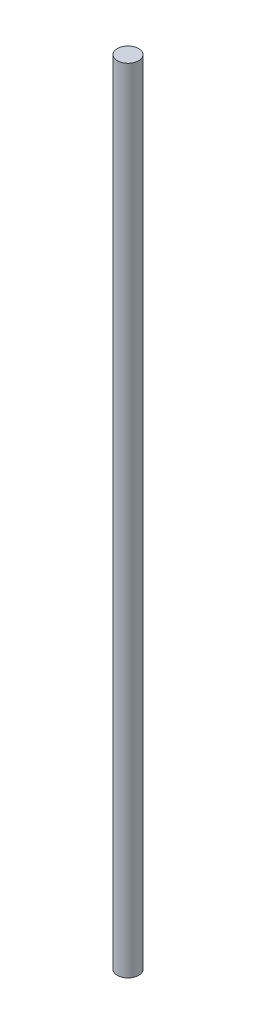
ISO-10303-21;
HEADER;
FILE_DESCRIPTION(('STEP AP214'),'2;1');
FILE_NAME('part.step','',(''),(''),'','','');
FILE_SCHEMA(('AUTOMOTIVE_DESIGN { 1 0 10303 214 1 1 1 1 }'));
ENDSEC;
DATA;
#1=APPLICATION_CONTEXT('core data for automotive mechanical design processes');
#2=APPLICATION_PROTOCOL_DEFINITION('international standard','automotive_design',2000,#1);
#3=PRODUCT_CONTEXT('',#1,'mechanical');
#4=PRODUCT('Part','Part','',(#3));
#5=PRODUCT_RELATED_PRODUCT_CATEGORY('part','',(#4));
#6=PRODUCT_DEFINITION_FORMATION('','',#4);
#7=PRODUCT_DEFINITION_CONTEXT('part definition',#1,'design');
#8=PRODUCT_DEFINITION('design','',#6,#7);
#9=PRODUCT_DEFINITION_SHAPE('','',#8);
#10=(LENGTH_UNIT() NAMED_UNIT(*) SI_UNIT(.MILLI.,.METRE.));
#11=(NAMED_UNIT(*) PLANE_ANGLE_UNIT() SI_UNIT($,.RADIAN.));
#12=(NAMED_UNIT(*) SI_UNIT($,.STERADIAN.) SOLID_ANGLE_UNIT());
#13=UNCERTAINTY_MEASURE_WITH_UNIT(LENGTH_MEASURE(1.E-05),#10,'distance_accuracy_value','');
#14=(GEOMETRIC_REPRESENTATION_CONTEXT(3) GLOBAL_UNCERTAINTY_ASSIGNED_CONTEXT((#13)) GLOBAL_UNIT_ASSIGNED_CONTEXT((#10,
#11,#12)) REPRESENTATION_CONTEXT('',''));
#15=CARTESIAN_POINT('',(0.,0.,0.));
#16=DIRECTION('',(0.,0.,1.));
#17=DIRECTION('',(1.,0.,0.));
#18=AXIS2_PLACEMENT_3D('',#15,#16,#17);
#19=CARTESIAN_POINT('',(0.,305.,0.));
#20=DIRECTION('',(0.,-1.,0.));
#21=DIRECTION('',(0.,0.,-1.));
#22=AXIS2_PLACEMENT_3D('',#19,#20,#21);
#23=CYLINDRICAL_SURFACE('',#22,4.);
#24=CARTESIAN_POINT('',(0.,305.,0.));
#25=DIRECTION('',(0.,1.,0.));
#26=DIRECTION('',(0.,0.,1.));
#27=AXIS2_PLACEMENT_3D('',#24,#25,#26);
#28=CIRCLE('',#27,4.);
#29=CARTESIAN_POINT('',(0.,305.,4.));
#30=VERTEX_POINT('',#29);
#31=EDGE_CURVE('E10',#30,#30,#28,.T.);
#32=ORIENTED_EDGE('',*,*,#31,.F.);
#33=EDGE_LOOP('',(#32));
#34=FACE_BOUND('',#33,.T.);
#35=CARTESIAN_POINT('',(9.92324438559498E-13,5.99999999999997,-4.57982980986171E-12));
#36=DIRECTION('',(0.,-1.,0.));
#37=DIRECTION('',(0.,0.,-1.));
#38=AXIS2_PLACEMENT_3D('',#35,#36,#37);
#39=CIRCLE('',#38,4.00000000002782);
#40=CARTESIAN_POINT('',(9.92324438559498E-13,5.99999999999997,-4.0000000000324));
#41=VERTEX_POINT('',#40);
#42=EDGE_CURVE('E37',#41,#41,#39,.T.);
#43=ORIENTED_EDGE('',*,*,#42,.F.);
#44=EDGE_LOOP('',(#43));
#45=FACE_BOUND('',#44,.T.);
#46=ADVANCED_FACE('F31',(#34,#45),#23,.T.);
#47=CARTESIAN_POINT('',(0.,305.,0.));
#48=DIRECTION('',(0.,1.,0.));
#49=DIRECTION('',(0.,0.,1.));
#50=AXIS2_PLACEMENT_3D('',#47,#48,#49);
#51=PLANE('',#50);
#52=ORIENTED_EDGE('',*,*,#31,.T.);
#53=EDGE_LOOP('',(#52));
#54=FACE_BOUND('',#53,.T.);
#55=ADVANCED_FACE('F46',(#54),#51,.T.);
#56=CARTESIAN_POINT('',(9.92324438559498E-13,5.99999999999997,-4.57982980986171E-12));
#57=DIRECTION('',(0.,-1.,0.));
#58=DIRECTION('',(0.,0.,-1.));
#59=AXIS2_PLACEMENT_3D('',#56,#57,#58);
#60=PLANE('',#59);
#61=ORIENTED_EDGE('',*,*,#42,.T.);
#62=EDGE_LOOP('',(#61));
#63=FACE_BOUND('',#62,.T.);
#64=ADVANCED_FACE('F43',(#63),#60,.T.);
#65=CLOSED_SHELL('',(#46,#55,#64));
#66=MANIFOLD_SOLID_BREP('B2',#65);
#67=ADVANCED_BREP_SHAPE_REPRESENTATION('',(#18,#66),#14);
#68=SHAPE_DEFINITION_REPRESENTATION(#9,#67);
ENDSEC;
END-ISO-10303-21;
